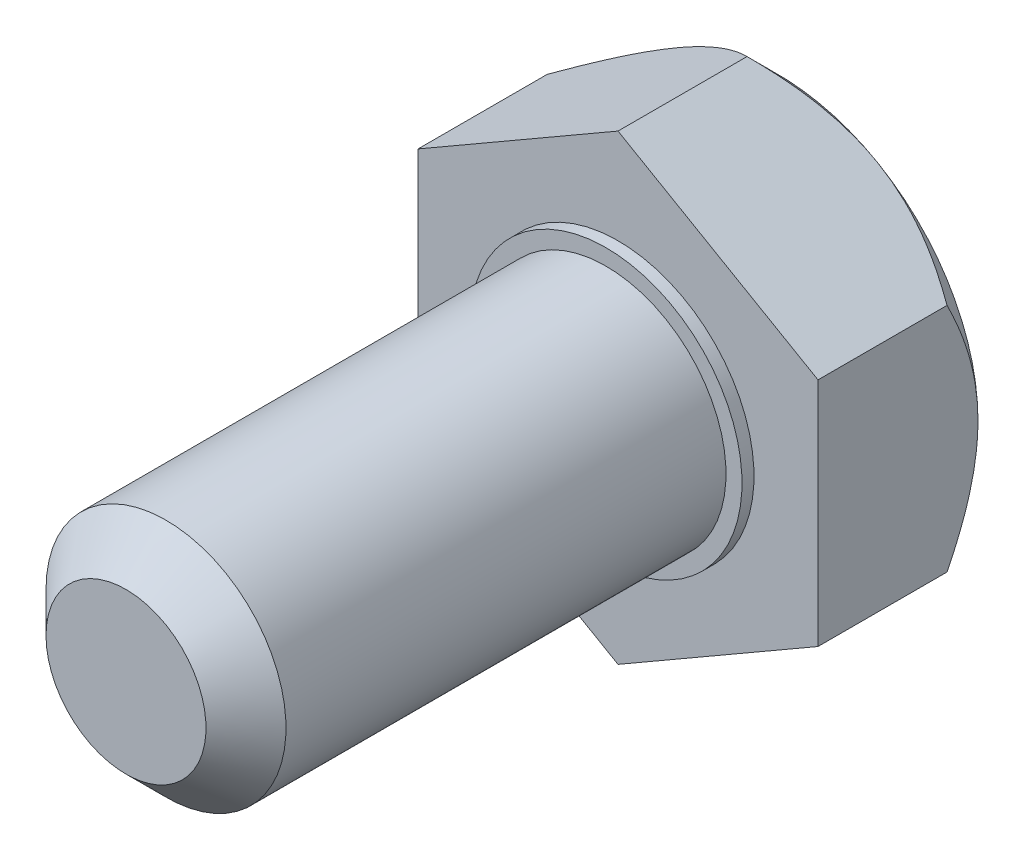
from build123d import *

# Parameters (mm, degrees)
BASE_EXTRUDE_DEPTH  = 2
SKETCH5_R           = 3.4
BOSS_EXTRUDE1_DEPTH = 0.3
SKETCH6_R           = 3
BOSS_EXTRUDE2_DEPTH = 12
CHAMFER1_SIZE       = 1


with BuildPart() as part:
    # Sketch1 → Base-Extrude (new, symmetric)
    with BuildSketch(Plane.XY):
        Polygon((5, 2.886751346), (5, -2.886751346), (0, -5.773502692), (-5, -2.886751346), (-5, 2.886751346), (0, 5.773502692), align=None)
    extrude(amount=BASE_EXTRUDE_DEPTH, both=True)

    # Sketch3 → Cut-Revolve1 (revolve, cut)
    with BuildSketch(Plane(origin=(0, 0, 0), x_dir=(1, 0, 0), z_dir=(0, 1, 0))):
        Polygon((-10, 2), (-5, 2), (-10, -3), align=None)
    revolve(axis=Axis((0, 0, -2), (0, 0, 1)), mode=Mode.SUBTRACT)

    # Sketch5 → Boss-Extrude1 (add)
    with BuildSketch(Plane.XY.offset(2)):
        Circle(SKETCH5_R)
    extrude(amount=BOSS_EXTRUDE1_DEPTH)

    # Sketch6 → Boss-Extrude2 (add)
    with BuildSketch(Plane.XY.offset(2.3)):
        Circle(SKETCH6_R)
    extrude(amount=BOSS_EXTRUDE2_DEPTH)

    # Chamfer1
    chamfer1_edges = [part.edges().sort_by_distance(p)[0] for p in [
        (-3, 0, 14.3),
    ]]
    chamfer(chamfer1_edges, length=CHAMFER1_SIZE)


solid = part.part
